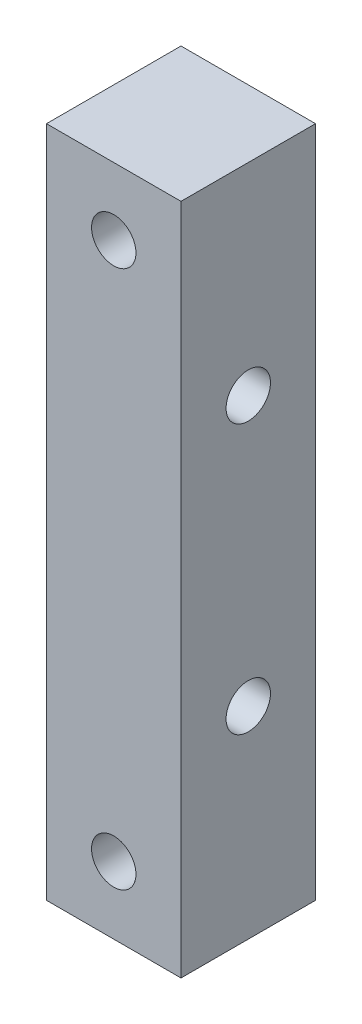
from build123d import *

# Parameters (mm, degrees)
SKETCH_1_W         = 10
SKETCH_1_H         = 10
EXTRUDE_1_DEPTH    = 50
HOLE_WIZARD_M4_1_D = 3.3
HOLE_WIZARD_M4_2_D = 3.3


with BuildPart() as part:
    # Sketch 1 → Extrude 1 (new body)
    with BuildSketch(Plane(origin=(0, 0, 0), x_dir=(1, 0, 0), z_dir=(0, 1, 0))):
        Rectangle(SKETCH_1_W, SKETCH_1_H)
    extrude(amount=EXTRUDE_1_DEPTH)

    # Hole Wizard M4 _1 (through all)
    with Locations(Plane.XY.offset(5)):
        with Locations((0, 45), (0, 5)):
            Hole(HOLE_WIZARD_M4_1_D / 2)

    # Hole Wizard M4 _2 (through all)
    with Locations(Plane(origin=(5, 0, 0), x_dir=(0, 0, -1), z_dir=(1, 0, 0))):
        with Locations((0, 35), (0, 15)):
            Hole(HOLE_WIZARD_M4_2_D / 2)


solid = part.part
